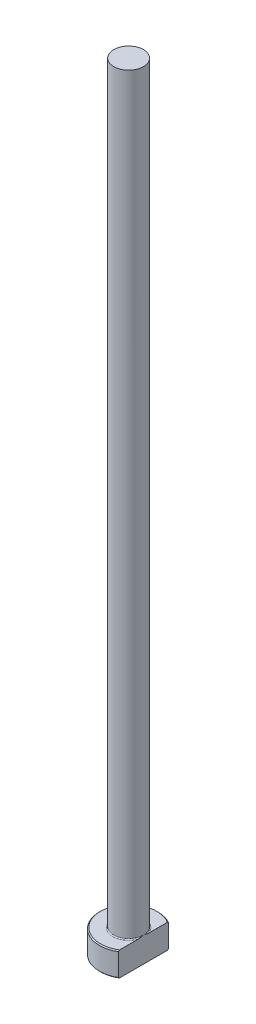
ISO-10303-21;
HEADER;
FILE_DESCRIPTION(('STEP AP214'),'2;1');
FILE_NAME('part.step','',(''),(''),'','','');
FILE_SCHEMA(('AUTOMOTIVE_DESIGN { 1 0 10303 214 1 1 1 1 }'));
ENDSEC;
DATA;
#1=APPLICATION_CONTEXT('core data for automotive mechanical design processes');
#2=APPLICATION_PROTOCOL_DEFINITION('international standard','automotive_design',2000,#1);
#3=PRODUCT_CONTEXT('',#1,'mechanical');
#4=PRODUCT('Part','Part','',(#3));
#5=PRODUCT_RELATED_PRODUCT_CATEGORY('part','',(#4));
#6=PRODUCT_DEFINITION_FORMATION('','',#4);
#7=PRODUCT_DEFINITION_CONTEXT('part definition',#1,'design');
#8=PRODUCT_DEFINITION('design','',#6,#7);
#9=PRODUCT_DEFINITION_SHAPE('','',#8);
#10=(LENGTH_UNIT() NAMED_UNIT(*) SI_UNIT(.MILLI.,.METRE.));
#11=(NAMED_UNIT(*) PLANE_ANGLE_UNIT() SI_UNIT($,.RADIAN.));
#12=(NAMED_UNIT(*) SI_UNIT($,.STERADIAN.) SOLID_ANGLE_UNIT());
#13=UNCERTAINTY_MEASURE_WITH_UNIT(LENGTH_MEASURE(1.E-05),#10,'distance_accuracy_value','');
#14=(GEOMETRIC_REPRESENTATION_CONTEXT(3) GLOBAL_UNCERTAINTY_ASSIGNED_CONTEXT((#13)) GLOBAL_UNIT_ASSIGNED_CONTEXT((#10,
#11,#12)) REPRESENTATION_CONTEXT('',''));
#15=CARTESIAN_POINT('',(0.,0.,0.));
#16=DIRECTION('',(0.,0.,1.));
#17=DIRECTION('',(1.,0.,0.));
#18=AXIS2_PLACEMENT_3D('',#15,#16,#17);
#19=CARTESIAN_POINT('',(0.,0.,0.));
#20=DIRECTION('',(0.,-1.,0.));
#21=DIRECTION('',(0.,0.,-1.));
#22=AXIS2_PLACEMENT_3D('',#19,#20,#21);
#23=PLANE('',#22);
#24=CARTESIAN_POINT('',(0.,0.,0.));
#25=DIRECTION('',(0.,-1.,0.));
#26=DIRECTION('',(0.,0.,-1.));
#27=AXIS2_PLACEMENT_3D('',#24,#25,#26);
#28=CIRCLE('',#27,5.79999999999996);
#29=CARTESIAN_POINT('',(3.04999999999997,0.,4.93330518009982));
#30=VERTEX_POINT('',#29);
#31=CARTESIAN_POINT('',(3.04999999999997,0.,-4.93330518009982));
#32=VERTEX_POINT('',#31);
#33=EDGE_CURVE('E98',#30,#32,#28,.T.);
#34=ORIENTED_EDGE('',*,*,#33,.T.);
#35=DIRECTION('',(0.,0.,1.));
#36=VECTOR('',#35,1.);
#37=CARTESIAN_POINT('',(3.04999999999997,0.,-5.16696235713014));
#38=LINE('',#37,#36);
#39=EDGE_CURVE('E83',#32,#30,#38,.T.);
#40=ORIENTED_EDGE('',*,*,#39,.T.);
#41=EDGE_LOOP('',(#34,#40));
#42=FACE_BOUND('',#41,.T.);
#43=ADVANCED_FACE('F32',(#42),#23,.T.);
#44=CARTESIAN_POINT('',(0.,259.958771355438,0.));
#45=DIRECTION('',(0.,1.,0.));
#46=DIRECTION('',(0.,0.,1.));
#47=AXIS2_PLACEMENT_3D('',#44,#45,#46);
#48=CYLINDRICAL_SURFACE('',#47,5.99999999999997);
#49=CARTESIAN_POINT('',(0.,4.79999999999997,0.));
#50=DIRECTION('',(0.,1.,0.));
#51=DIRECTION('',(0.,0.,1.));
#52=AXIS2_PLACEMENT_3D('',#49,#50,#51);
#53=CIRCLE('',#52,5.99999999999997);
#54=CARTESIAN_POINT('',(3.04999999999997,4.79999999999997,5.16696235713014));
#55=VERTEX_POINT('',#54);
#56=CARTESIAN_POINT('',(3.04999999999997,4.79999999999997,-5.16696235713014));
#57=VERTEX_POINT('',#56);
#58=EDGE_CURVE('E104',#55,#57,#53,.F.);
#59=ORIENTED_EDGE('',*,*,#58,.T.);
#60=DIRECTION('',(0.,-1.,0.));
#61=VECTOR('',#60,1.);
#62=CARTESIAN_POINT('',(3.04999999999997,160.,-5.16696235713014));
#63=LINE('',#62,#61);
#64=CARTESIAN_POINT('',(3.04999999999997,0.199999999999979,-5.16696235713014));
#65=VERTEX_POINT('',#64);
#66=EDGE_CURVE('E183',#57,#65,#63,.T.);
#67=ORIENTED_EDGE('',*,*,#66,.T.);
#68=CARTESIAN_POINT('',(0.,0.199999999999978,0.));
#69=DIRECTION('',(0.,-1.,0.));
#70=DIRECTION('',(0.,0.,-1.));
#71=AXIS2_PLACEMENT_3D('',#68,#69,#70);
#72=CIRCLE('',#71,5.99999999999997);
#73=CARTESIAN_POINT('',(3.04999999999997,0.199999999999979,5.16696235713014));
#74=VERTEX_POINT('',#73);
#75=EDGE_CURVE('E100',#65,#74,#72,.F.);
#76=ORIENTED_EDGE('',*,*,#75,.T.);
#77=DIRECTION('',(0.,-1.,0.));
#78=VECTOR('',#77,1.);
#79=CARTESIAN_POINT('',(3.04999999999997,160.,5.16696235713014));
#80=LINE('',#79,#78);
#81=EDGE_CURVE('E93',#55,#74,#80,.T.);
#82=ORIENTED_EDGE('',*,*,#81,.F.);
#83=EDGE_LOOP('',(#59,#67,#76,#82));
#84=FACE_BOUND('',#83,.T.);
#85=ADVANCED_FACE('F158',(#84),#48,.T.);
#86=CARTESIAN_POINT('',(-5.99999999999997,5.,0.));
#87=DIRECTION('',(0.,1.,0.));
#88=DIRECTION('',(0.,0.,1.));
#89=AXIS2_PLACEMENT_3D('',#86,#87,#88);
#90=PLANE('',#89);
#91=CARTESIAN_POINT('',(0.,5.,0.));
#92=DIRECTION('',(0.,1.,0.));
#93=DIRECTION('',(0.,0.,1.));
#94=AXIS2_PLACEMENT_3D('',#91,#92,#93);
#95=CIRCLE('',#94,5.79999999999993);
#96=CARTESIAN_POINT('',(3.04999999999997,5.,-4.93330518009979));
#97=VERTEX_POINT('',#96);
#98=CARTESIAN_POINT('',(3.04999999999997,5.,4.93330518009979));
#99=VERTEX_POINT('',#98);
#100=EDGE_CURVE('E178',#97,#99,#95,.T.);
#101=ORIENTED_EDGE('',*,*,#100,.T.);
#102=DIRECTION('',(0.,0.,-1.));
#103=VECTOR('',#102,1.);
#104=CARTESIAN_POINT('',(3.04999999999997,5.,0.));
#105=LINE('',#104,#103);
#106=CARTESIAN_POINT('',(3.04999999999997,4.99999999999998,1.12249721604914));
#107=VERTEX_POINT('',#106);
#108=EDGE_CURVE('E57',#99,#107,#105,.T.);
#109=ORIENTED_EDGE('',*,*,#108,.T.);
#110=CARTESIAN_POINT('',(0.,5.,0.));
#111=DIRECTION('',(0.,1.,0.));
#112=DIRECTION('',(0.,0.,1.));
#113=AXIS2_PLACEMENT_3D('',#110,#111,#112);
#114=CIRCLE('',#113,3.24999999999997);
#115=CARTESIAN_POINT('',(3.04999999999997,4.99999999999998,-1.12249721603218));
#116=VERTEX_POINT('',#115);
#117=EDGE_CURVE('E107',#107,#116,#114,.F.);
#118=ORIENTED_EDGE('',*,*,#117,.T.);
#119=EDGE_CURVE('E136',#116,#97,#105,.T.);
#120=ORIENTED_EDGE('',*,*,#119,.T.);
#121=EDGE_LOOP('',(#101,#109,#118,#120));
#122=FACE_BOUND('',#121,.T.);
#123=ADVANCED_FACE('F147',(#122),#90,.T.);
#124=CARTESIAN_POINT('',(0.,5.,0.));
#125=DIRECTION('',(0.,-1.,0.));
#126=DIRECTION('',(0.,0.,-1.));
#127=AXIS2_PLACEMENT_3D('',#124,#125,#126);
#128=CONICAL_SURFACE('',#127,5.79999999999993,0.785398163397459);
#129=ORIENTED_EDGE('',*,*,#58,.F.);
#130=CARTESIAN_POINT('',(3.04999999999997,-0.970698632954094,11.3686783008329));
#131=CARTESIAN_POINT('',(3.04999999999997,-0.729844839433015,11.1192942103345));
#132=CARTESIAN_POINT('',(3.04999999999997,-0.489253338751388,10.8696559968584));
#133=CARTESIAN_POINT('',(3.04999999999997,-0.0087427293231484,10.3697279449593));
#134=CARTESIAN_POINT('',(3.04999999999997,0.231176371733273,10.1194380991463));
#135=CARTESIAN_POINT('',(3.04999999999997,0.710295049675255,9.61795795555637));
#136=CARTESIAN_POINT('',(3.04999999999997,0.949494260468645,9.3667673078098));
#137=CARTESIAN_POINT('',(3.04999999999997,1.42684960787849,8.8633987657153));
#138=CARTESIAN_POINT('',(3.04999999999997,1.66500575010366,8.61122087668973));
#139=CARTESIAN_POINT('',(3.04999999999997,2.13559657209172,8.11027905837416));
#140=CARTESIAN_POINT('',(3.04999999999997,2.36805568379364,7.86153809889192));
#141=CARTESIAN_POINT('',(3.04999999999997,2.8312952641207,7.36249846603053));
#142=CARTESIAN_POINT('',(3.04999999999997,3.06207574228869,7.11219980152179));
#143=CARTESIAN_POINT('',(3.04999999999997,3.5213463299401,6.60959354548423));
#144=CARTESIAN_POINT('',(3.04999999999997,3.74983686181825,6.3572863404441));
#145=CARTESIAN_POINT('',(3.04999999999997,4.20371775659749,5.84990299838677));
#146=CARTESIAN_POINT('',(3.04999999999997,4.42910822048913,5.59482695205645));
#147=CARTESIAN_POINT('',(3.04999999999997,4.79887807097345,5.16894007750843));
#148=CARTESIAN_POINT('',(3.04999999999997,4.94452846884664,4.99923427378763));
#149=CARTESIAN_POINT('',(3.04999999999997,5.23331494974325,4.6576627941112));
#150=CARTESIAN_POINT('',(3.04999999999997,5.37645078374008,4.48579690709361));
#151=CARTESIAN_POINT('',(3.04999999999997,5.66079096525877,4.13753558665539));
#152=CARTESIAN_POINT('',(3.04999999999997,5.80196080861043,3.96111185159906));
#153=CARTESIAN_POINT('',(3.04999999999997,6.07950752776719,3.60459087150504));
#154=CARTESIAN_POINT('',(3.04999999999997,6.21588558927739,3.42449455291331));
#155=CARTESIAN_POINT('',(3.04999999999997,6.48382052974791,3.05665019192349));
#156=CARTESIAN_POINT('',(3.04999999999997,6.61527833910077,2.86882893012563));
#157=CARTESIAN_POINT('',(3.04999999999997,6.80466567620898,2.58172885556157));
#158=CARTESIAN_POINT('',(3.04999999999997,6.86653995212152,2.48505688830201));
#159=CARTESIAN_POINT('',(3.04999999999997,6.98697221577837,2.28967595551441));
#160=CARTESIAN_POINT('',(3.04999999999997,7.04553056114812,2.1909672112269));
#161=CARTESIAN_POINT('',(3.04999999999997,7.15784145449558,1.99234566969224));
#162=CARTESIAN_POINT('',(3.04999999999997,7.2116422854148,1.89246054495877));
#163=CARTESIAN_POINT('',(3.04999999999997,7.31412145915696,1.69011096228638));
#164=CARTESIAN_POINT('',(3.04999999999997,7.36279884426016,1.58764602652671));
#165=CARTESIAN_POINT('',(3.04999999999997,7.49891065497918,1.27646394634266));
#166=CARTESIAN_POINT('',(3.04999999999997,7.57686498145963,1.06321933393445));
#167=CARTESIAN_POINT('',(3.04999999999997,7.66214701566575,0.743707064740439));
#168=CARTESIAN_POINT('',(3.04999999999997,7.68491750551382,0.641524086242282));
#169=CARTESIAN_POINT('',(3.04999999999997,7.72074349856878,0.4354325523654));
#170=CARTESIAN_POINT('',(3.04999999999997,7.73379998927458,0.331524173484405));
#171=CARTESIAN_POINT('',(3.04999999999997,7.74926869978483,0.123282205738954));
#172=CARTESIAN_POINT('',(3.04999999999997,7.75171909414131,0.0189514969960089));
#173=CARTESIAN_POINT('',(3.04999999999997,7.74589964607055,-0.189412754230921));
#174=CARTESIAN_POINT('',(3.04999999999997,7.7376290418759,-0.293446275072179));
#175=CARTESIAN_POINT('',(3.04999999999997,7.71106535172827,-0.499372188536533));
#176=CARTESIAN_POINT('',(3.04999999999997,7.69285104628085,-0.60127495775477));
#177=CARTESIAN_POINT('',(3.04999999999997,7.64758004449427,-0.803076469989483));
#178=CARTESIAN_POINT('',(3.04999999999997,7.62052218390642,-0.902974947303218));
#179=CARTESIAN_POINT('',(3.04999999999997,7.55873377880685,-1.10100969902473));
#180=CARTESIAN_POINT('',(3.04999999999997,7.52395724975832,-1.19913143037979));
#181=CARTESIAN_POINT('',(3.04999999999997,7.44818034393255,-1.39288710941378));
#182=CARTESIAN_POINT('',(3.04999999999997,7.40718118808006,-1.48852154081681));
#183=CARTESIAN_POINT('',(3.04999999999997,7.278801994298,-1.76725558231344));
#184=CARTESIAN_POINT('',(3.04999999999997,7.18437453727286,-1.94709912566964));
#185=CARTESIAN_POINT('',(3.04999999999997,6.98292889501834,-2.29966178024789));
#186=CARTESIAN_POINT('',(3.04999999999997,6.87589523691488,-2.4723717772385));
#187=CARTESIAN_POINT('',(3.04999999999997,6.65293850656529,-2.81286471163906));
#188=CARTESIAN_POINT('',(3.04999999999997,6.53698257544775,-2.98062594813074));
#189=CARTESIAN_POINT('',(3.04999999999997,6.29920889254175,-3.31177740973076));
#190=CARTESIAN_POINT('',(3.04999999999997,6.17739401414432,-3.4751697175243));
#191=CARTESIAN_POINT('',(3.04999999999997,5.92790480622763,-3.80077365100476));
#192=CARTESIAN_POINT('',(3.04999999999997,5.80017502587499,-3.96294258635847));
#193=CARTESIAN_POINT('',(3.04999999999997,5.54148279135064,-4.28469855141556));
#194=CARTESIAN_POINT('',(3.04999999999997,5.41052000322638,-4.4442853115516));
#195=CARTESIAN_POINT('',(3.04999999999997,5.14647056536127,-4.76104235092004));
#196=CARTESIAN_POINT('',(3.04999999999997,5.01338972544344,-4.91821748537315));
#197=CARTESIAN_POINT('',(3.04999999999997,4.74534141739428,-5.23095234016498));
#198=CARTESIAN_POINT('',(3.04999999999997,4.6103739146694,-5.38651203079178));
#199=CARTESIAN_POINT('',(3.04999999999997,4.25119607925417,-5.7965100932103));
#200=CARTESIAN_POINT('',(3.04999999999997,4.02571738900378,-6.04983649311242));
#201=CARTESIAN_POINT('',(3.04999999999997,3.57194090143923,-6.55395552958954));
#202=CARTESIAN_POINT('',(3.04999999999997,3.3436430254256,-6.80474809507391));
#203=CARTESIAN_POINT('',(3.04999999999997,2.88477169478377,-7.30466840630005));
#204=CARTESIAN_POINT('',(3.04999999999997,2.65419632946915,-7.55379439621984));
#205=CARTESIAN_POINT('',(3.04999999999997,2.19148976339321,-8.0505971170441));
#206=CARTESIAN_POINT('',(3.04999999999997,1.95935855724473,-8.29827384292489));
#207=CARTESIAN_POINT('',(3.04999999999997,1.50341144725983,-8.78239136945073));
#208=CARTESIAN_POINT('',(3.04999999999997,1.27964364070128,-9.01887750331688));
#209=CARTESIAN_POINT('',(3.04999999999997,0.831227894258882,-9.4910152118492));
#210=CARTESIAN_POINT('',(3.04999999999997,0.606579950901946,-9.72666678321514));
#211=CARTESIAN_POINT('',(3.04999999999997,0.156823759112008,-10.1970312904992));
#212=CARTESIAN_POINT('',(3.04999999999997,-0.0682837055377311,-10.4317449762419));
#213=CARTESIAN_POINT('',(3.04999999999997,-0.519082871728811,-10.9006068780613));
#214=CARTESIAN_POINT('',(3.04999999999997,-0.744774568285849,-11.1347550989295));
#215=CARTESIAN_POINT('',(3.04999999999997,-0.970698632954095,-11.3686783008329));
#216=B_SPLINE_CURVE_WITH_KNOTS('',3,(#130,#131,#132,#133,#134,#135,#136,#137,#138,#139,#140,
#141,#142,#143,#144,#145,#146,#147,#148,#149,#150,#151,#152,#153,#154,#155,#156,#157,#158,#159,
#160,#161,#162,#163,#164,#165,#166,#167,#168,#169,#170,#171,#172,#173,#174,#175,#176,#177,#178,
#179,#180,#181,#182,#183,#184,#185,#186,#187,#188,#189,#190,#191,#192,#193,#194,#195,#196,#197,
#198,#199,#200,#201,#202,#203,#204,#205,#206,#207,#208,#209,#210,#211,#212,#213,#214,#215),
.UNSPECIFIED.,.F.,.F.,(4,2,2,2,2,2,2,2,2,2,2,2,2,2,2,2,2,2,2,2,2,2,2,2,2,2,2,2,2,2,2,2,2,2,2,2,
2,2,2,2,2,2,4),(0.,1.04010969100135,2.08023122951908,3.12081383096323,4.16139083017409,
5.18274882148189,6.2041010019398,7.22526118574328,8.24638802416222,8.91728465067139,
9.58824734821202,10.2660415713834,10.9436668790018,11.6311554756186,11.9754354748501,
12.3196782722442,12.6598862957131,13.0001578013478,13.6781281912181,13.9918165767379,
14.3054730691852,14.6179996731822,14.9305484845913,15.2406562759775,15.550804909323,
15.8628533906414,16.1748407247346,16.7833414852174,17.3925970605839,18.0042149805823,
18.6155359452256,19.2347734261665,19.8540751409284,20.471899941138,21.0897360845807,
22.1071178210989,23.1245280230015,24.1428799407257,25.161235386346,26.1379513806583,
27.1146712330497,28.090310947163,29.065942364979),.UNSPECIFIED.);
#217=EDGE_CURVE('E135',#55,#99,#216,.T.);
#218=ORIENTED_EDGE('',*,*,#217,.T.);
#219=ORIENTED_EDGE('',*,*,#100,.F.);
#220=EDGE_CURVE('E127',#97,#57,#216,.T.);
#221=ORIENTED_EDGE('',*,*,#220,.T.);
#222=EDGE_LOOP('',(#129,#218,#219,#221));
#223=FACE_BOUND('',#222,.T.);
#224=ADVANCED_FACE('F143',(#223),#128,.T.);
#225=CARTESIAN_POINT('',(0.,0.199999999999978,0.));
#226=DIRECTION('',(0.,1.,0.));
#227=DIRECTION('',(0.,0.,1.));
#228=AXIS2_PLACEMENT_3D('',#225,#226,#227);
#229=CONICAL_SURFACE('',#228,5.99999999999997,0.785398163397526);
#230=ORIENTED_EDGE('',*,*,#75,.F.);
#231=CARTESIAN_POINT('',(3.04999999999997,5.97069863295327,-11.3686783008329));
#232=CARTESIAN_POINT('',(3.04999999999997,5.72984483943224,-11.1192942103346));
#233=CARTESIAN_POINT('',(3.04999999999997,5.48925333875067,-10.8696559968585));
#234=CARTESIAN_POINT('',(3.04999999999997,5.00874272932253,-10.3697279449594));
#235=CARTESIAN_POINT('',(3.04999999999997,4.76882362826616,-10.1194380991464));
#236=CARTESIAN_POINT('',(3.04999999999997,4.28970495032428,-9.61795795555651));
#237=CARTESIAN_POINT('',(3.04999999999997,4.05050573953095,-9.36676730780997));
#238=CARTESIAN_POINT('',(3.04999999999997,3.57315039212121,-8.86339876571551));
#239=CARTESIAN_POINT('',(3.04999999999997,3.33499424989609,-8.61122087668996));
#240=CARTESIAN_POINT('',(3.04999999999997,2.86440342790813,-8.11027905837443));
#241=CARTESIAN_POINT('',(3.04999999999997,2.63194431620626,-7.86153809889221));
#242=CARTESIAN_POINT('',(3.04999999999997,2.16870473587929,-7.36249846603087));
#243=CARTESIAN_POINT('',(3.04999999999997,1.93792425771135,-7.11219980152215));
#244=CARTESIAN_POINT('',(3.04999999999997,1.47865367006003,-6.60959354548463));
#245=CARTESIAN_POINT('',(3.04999999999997,1.25016313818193,-6.35728634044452));
#246=CARTESIAN_POINT('',(3.04999999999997,0.796282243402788,-5.84990299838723));
#247=CARTESIAN_POINT('',(3.04999999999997,0.570891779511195,-5.59482695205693));
#248=CARTESIAN_POINT('',(3.04999999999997,0.201121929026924,-5.16894007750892));
#249=CARTESIAN_POINT('',(3.04999999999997,0.0554715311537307,-4.99923427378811));
#250=CARTESIAN_POINT('',(3.04999999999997,-0.233314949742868,-4.65766279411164));
#251=CARTESIAN_POINT('',(3.04999999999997,-0.376450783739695,-4.48579690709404));
#252=CARTESIAN_POINT('',(3.04999999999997,-0.660790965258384,-4.1375355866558));
#253=CARTESIAN_POINT('',(3.04999999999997,-0.801960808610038,-3.96111185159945));
#254=CARTESIAN_POINT('',(3.04999999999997,-1.07950752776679,-3.6045908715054));
#255=CARTESIAN_POINT('',(3.04999999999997,-1.21588558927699,-3.42449455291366));
#256=CARTESIAN_POINT('',(3.04999999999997,-1.4838205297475,-3.05665019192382));
#257=CARTESIAN_POINT('',(3.04999999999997,-1.61527833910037,-2.86882893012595));
#258=CARTESIAN_POINT('',(3.04999999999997,-1.80466567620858,-2.58172885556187));
#259=CARTESIAN_POINT('',(3.04999999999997,-1.86653995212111,-2.4850568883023));
#260=CARTESIAN_POINT('',(3.04999999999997,-1.98697221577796,-2.28967595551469));
#261=CARTESIAN_POINT('',(3.04999999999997,-2.04553056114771,-2.19096721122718));
#262=CARTESIAN_POINT('',(3.04999999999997,-2.15784145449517,-1.99234566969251));
#263=CARTESIAN_POINT('',(3.04999999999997,-2.21164228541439,-1.89246054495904));
#264=CARTESIAN_POINT('',(3.04999999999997,-2.31412145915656,-1.69011096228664));
#265=CARTESIAN_POINT('',(3.04999999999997,-2.36279884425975,-1.58764602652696));
#266=CARTESIAN_POINT('',(3.04999999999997,-2.49891065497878,-1.2764639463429));
#267=CARTESIAN_POINT('',(3.04999999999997,-2.57686498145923,-1.06321933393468));
#268=CARTESIAN_POINT('',(3.04999999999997,-2.66214701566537,-0.743707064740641));
#269=CARTESIAN_POINT('',(3.04999999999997,-2.68491750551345,-0.641524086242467));
#270=CARTESIAN_POINT('',(3.04999999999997,-2.72074349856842,-0.43543255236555));
#271=CARTESIAN_POINT('',(3.04999999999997,-2.73379998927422,-0.331524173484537));
#272=CARTESIAN_POINT('',(3.04999999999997,-2.74926869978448,-0.123282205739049));
#273=CARTESIAN_POINT('',(3.04999999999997,-2.75171909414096,-0.0189514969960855));
#274=CARTESIAN_POINT('',(3.04999999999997,-2.74589964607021,0.189412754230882));
#275=CARTESIAN_POINT('',(3.04999999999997,-2.73762904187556,0.293446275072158));
#276=CARTESIAN_POINT('',(3.04999999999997,-2.71106535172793,0.499372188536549));
#277=CARTESIAN_POINT('',(3.04999999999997,-2.69285104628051,0.601274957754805));
#278=CARTESIAN_POINT('',(3.04999999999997,-2.64758004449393,0.803076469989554));
#279=CARTESIAN_POINT('',(3.04999999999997,-2.62052218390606,0.902974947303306));
#280=CARTESIAN_POINT('',(3.04999999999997,-2.55873377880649,1.10100969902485));
#281=CARTESIAN_POINT('',(3.04999999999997,-2.52395724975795,1.19913143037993));
#282=CARTESIAN_POINT('',(3.04999999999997,-2.44818034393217,1.39288710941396));
#283=CARTESIAN_POINT('',(3.04999999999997,-2.40718118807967,1.488521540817));
#284=CARTESIAN_POINT('',(3.04999999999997,-2.27880199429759,1.76725558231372));
#285=CARTESIAN_POINT('',(3.04999999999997,-2.18437453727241,1.94709912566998));
#286=CARTESIAN_POINT('',(3.04999999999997,-1.98292889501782,2.29966178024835));
#287=CARTESIAN_POINT('',(3.04999999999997,-1.87589523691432,2.47237177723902));
#288=CARTESIAN_POINT('',(3.04999999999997,-1.65293850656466,2.8128647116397));
#289=CARTESIAN_POINT('',(3.04999999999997,-1.53698257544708,2.98062594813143));
#290=CARTESIAN_POINT('',(3.04999999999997,-1.299208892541,3.31177740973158));
#291=CARTESIAN_POINT('',(3.04999999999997,-1.17739401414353,3.47516971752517));
#292=CARTESIAN_POINT('',(3.04999999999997,-0.927904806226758,3.80077365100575));
#293=CARTESIAN_POINT('',(3.04999999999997,-0.800175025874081,3.96294258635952));
#294=CARTESIAN_POINT('',(3.04999999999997,-0.541482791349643,4.28469855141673));
#295=CARTESIAN_POINT('',(3.04999999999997,-0.410520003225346,4.44428531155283));
#296=CARTESIAN_POINT('',(3.04999999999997,-0.146470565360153,4.76104235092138));
#297=CARTESIAN_POINT('',(3.04999999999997,-0.0133897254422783,4.91821748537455));
#298=CARTESIAN_POINT('',(3.04999999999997,0.254658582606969,5.23095234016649));
#299=CARTESIAN_POINT('',(3.04999999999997,0.389626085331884,5.38651203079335));
#300=CARTESIAN_POINT('',(3.04999999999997,0.748803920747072,5.79651009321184));
#301=CARTESIAN_POINT('',(3.04999999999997,0.974282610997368,6.04983649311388));
#302=CARTESIAN_POINT('',(3.04999999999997,1.42805909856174,6.55395552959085));
#303=CARTESIAN_POINT('',(3.04999999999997,1.65635697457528,6.80474809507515));
#304=CARTESIAN_POINT('',(3.04999999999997,2.11522830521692,7.30466840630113));
#305=CARTESIAN_POINT('',(3.04999999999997,2.34580367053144,7.55379439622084));
#306=CARTESIAN_POINT('',(3.04999999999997,2.8085102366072,8.05059711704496));
#307=CARTESIAN_POINT('',(3.04999999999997,3.04064144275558,8.29827384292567));
#308=CARTESIAN_POINT('',(3.04999999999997,3.49658855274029,8.78239136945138));
#309=CARTESIAN_POINT('',(3.04999999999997,3.72035635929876,9.01887750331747));
#310=CARTESIAN_POINT('',(3.04999999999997,4.16877210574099,9.49101521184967));
#311=CARTESIAN_POINT('',(3.04999999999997,4.39342004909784,9.72666678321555));
#312=CARTESIAN_POINT('',(3.04999999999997,4.8431762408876,10.1970312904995));
#313=CARTESIAN_POINT('',(3.04999999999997,5.06828370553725,10.4317449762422));
#314=CARTESIAN_POINT('',(3.04999999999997,5.51908287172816,10.9006068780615));
#315=CARTESIAN_POINT('',(3.04999999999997,5.74477456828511,11.1347550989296));
#316=CARTESIAN_POINT('',(3.04999999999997,5.97069863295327,11.3686783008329));
#317=B_SPLINE_CURVE_WITH_KNOTS('',3,(#231,#232,#233,#234,#235,#236,#237,#238,#239,#240,#241,
#242,#243,#244,#245,#246,#247,#248,#249,#250,#251,#252,#253,#254,#255,#256,#257,#258,#259,#260,
#261,#262,#263,#264,#265,#266,#267,#268,#269,#270,#271,#272,#273,#274,#275,#276,#277,#278,#279,
#280,#281,#282,#283,#284,#285,#286,#287,#288,#289,#290,#291,#292,#293,#294,#295,#296,#297,#298,
#299,#300,#301,#302,#303,#304,#305,#306,#307,#308,#309,#310,#311,#312,#313,#314,#315,#316),
.UNSPECIFIED.,.F.,.F.,(4,2,2,2,2,2,2,2,2,2,2,2,2,2,2,2,2,2,2,2,2,2,2,2,2,2,2,2,2,2,2,2,2,2,2,2,
2,2,2,2,2,2,4),(0.,1.04010969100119,2.08023122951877,3.12081383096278,4.16139083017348,
5.18274882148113,6.20410100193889,7.22526118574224,8.24638802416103,8.91728465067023,
9.58824734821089,10.2660415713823,10.9436668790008,11.6311554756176,11.975435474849,
12.3196782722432,12.6598862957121,13.0001578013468,13.6781281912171,13.991816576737,
14.3054730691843,14.6179996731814,14.9305484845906,15.2406562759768,15.5508049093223,
15.8628533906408,16.1748407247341,16.7833414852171,17.3925970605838,18.0042149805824,
18.6155359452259,19.234773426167,19.8540751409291,20.4718999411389,21.0897360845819,
22.1071178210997,23.124528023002,24.1428799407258,25.1612353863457,26.1379513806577,
27.1146712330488,28.0903109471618,29.0659423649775),.UNSPECIFIED.);
#318=EDGE_CURVE('E86',#65,#32,#317,.T.);
#319=ORIENTED_EDGE('',*,*,#318,.T.);
#320=ORIENTED_EDGE('',*,*,#33,.F.);
#321=EDGE_CURVE('E89',#30,#74,#317,.T.);
#322=ORIENTED_EDGE('',*,*,#321,.T.);
#323=EDGE_LOOP('',(#230,#319,#320,#322));
#324=FACE_BOUND('',#323,.T.);
#325=ADVANCED_FACE('F97',(#324),#229,.T.);
#326=CARTESIAN_POINT('',(0.,5.19999999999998,0.));
#327=DIRECTION('',(0.,1.,0.));
#328=DIRECTION('',(0.,0.,1.));
#329=AXIS2_PLACEMENT_3D('',#326,#327,#328);
#330=TOROIDAL_SURFACE('',#329,3.24999999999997,0.2);
#331=CARTESIAN_POINT('',(3.04999999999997,5.19999999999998,0.));
#332=CARTESIAN_POINT('',(3.04999999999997,5.20000050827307,1.21234498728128E-10));
#333=CARTESIAN_POINT('',(3.04999999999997,5.2000010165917,-1.94554167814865E-07));
#334=CARTESIAN_POINT('',(3.04999999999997,5.20000196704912,-7.36231908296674E-07));
#335=CARTESIAN_POINT('',(3.04999999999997,5.20000239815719,-1.09605845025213E-06));
#336=CARTESIAN_POINT('',(3.04999999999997,5.20000329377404,-1.95768484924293E-06));
#337=CARTESIAN_POINT('',(3.04999999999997,5.20000374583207,-2.47339958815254E-06));
#338=CARTESIAN_POINT('',(3.04999999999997,5.20000455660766,-3.54344299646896E-06));
#339=CARTESIAN_POINT('',(3.04999999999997,5.20000491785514,-4.0960013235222E-06));
#340=CARTESIAN_POINT('',(3.04999999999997,5.20000625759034,-6.23288240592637E-06));
#341=CARTESIAN_POINT('',(3.04999999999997,5.20000716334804,-7.86540857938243E-06));
#342=CARTESIAN_POINT('',(3.04999999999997,5.20000865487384,-1.11012618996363E-05));
#343=CARTESIAN_POINT('',(3.04999999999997,5.20000926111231,-1.26955485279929E-05));
#344=CARTESIAN_POINT('',(3.04999999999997,5.20001180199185,-1.94350330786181E-05));
#345=CARTESIAN_POINT('',(3.04999999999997,5.20001369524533,-2.45990996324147E-05));
#346=CARTESIAN_POINT('',(3.04999999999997,5.20001648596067,-3.43608245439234E-05));
#347=CARTESIAN_POINT('',(3.04999999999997,5.20001748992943,-3.892785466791E-05));
#348=CARTESIAN_POINT('',(3.04999999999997,5.20002479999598,-7.28490938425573E-05));
#349=CARTESIAN_POINT('',(3.04999999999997,5.20003033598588,-0.000102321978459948));
#350=CARTESIAN_POINT('',(3.04999999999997,5.2000545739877,-0.000218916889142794));
#351=CARTESIAN_POINT('',(3.04999999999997,5.20007771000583,-0.000305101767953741));
#352=CARTESIAN_POINT('',(3.04999999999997,5.20016793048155,-0.000646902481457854));
#353=CARTESIAN_POINT('',(3.04999999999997,5.20023214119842,-0.00090303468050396));
#354=CARTESIAN_POINT('',(3.04999999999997,5.20048959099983,-0.00192235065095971));
#355=CARTESIAN_POINT('',(3.04999999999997,5.200686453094,-0.00268486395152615));
#356=CARTESIAN_POINT('',(3.04999999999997,5.20150513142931,-0.0058644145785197));
#357=CARTESIAN_POINT('',(3.04999999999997,5.20212238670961,-0.00828229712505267));
#358=CARTESIAN_POINT('',(3.04999999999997,5.20733075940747,-0.0286735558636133));
#359=CARTESIAN_POINT('',(3.04999999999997,5.21193872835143,-0.0466439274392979));
#360=CARTESIAN_POINT('',(3.04999999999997,5.22094200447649,-0.0818758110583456));
#361=CARTESIAN_POINT('',(3.04999999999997,5.22533847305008,-0.0991370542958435));
#362=CARTESIAN_POINT('',(3.04999999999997,5.23964641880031,-0.155525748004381));
#363=CARTESIAN_POINT('',(3.04999999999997,5.24949334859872,-0.194669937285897));
#364=CARTESIAN_POINT('',(3.04999999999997,5.26604342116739,-0.261710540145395));
#365=CARTESIAN_POINT('',(3.04999999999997,5.27283214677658,-0.289585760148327));
#366=CARTESIAN_POINT('',(3.04999999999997,5.28599220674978,-0.344649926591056));
#367=CARTESIAN_POINT('',(3.04999999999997,5.29236984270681,-0.371837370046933));
#368=CARTESIAN_POINT('',(3.04999999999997,5.31157589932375,-0.455723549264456));
#369=CARTESIAN_POINT('',(3.04999999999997,5.32392035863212,-0.512535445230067));
#370=CARTESIAN_POINT('',(3.04999999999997,5.34680977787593,-0.627095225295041));
#371=CARTESIAN_POINT('',(3.04999999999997,5.35733631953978,-0.684846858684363));
#372=CARTESIAN_POINT('',(3.04999999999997,5.37641100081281,-0.805890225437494));
#373=CARTESIAN_POINT('',(3.04999999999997,5.38470472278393,-0.869223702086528));
#374=CARTESIAN_POINT('',(3.04999999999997,5.39650442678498,-0.996147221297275));
#375=CARTESIAN_POINT('',(3.04999999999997,5.40002782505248,-1.05973547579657));
#376=CARTESIAN_POINT('',(3.04999999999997,5.39997784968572,-1.17309949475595));
#377=CARTESIAN_POINT('',(3.04999999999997,5.39778745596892,-1.22285605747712));
#378=CARTESIAN_POINT('',(3.04999999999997,5.38969143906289,-1.29668621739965));
#379=CARTESIAN_POINT('',(3.04999999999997,5.38622595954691,-1.32101834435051));
#380=CARTESIAN_POINT('',(3.04999999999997,5.37728481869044,-1.36928415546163));
#381=CARTESIAN_POINT('',(3.04999999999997,5.37181197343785,-1.39321834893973));
#382=CARTESIAN_POINT('',(3.04999999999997,5.35809904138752,-1.44077878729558));
#383=CARTESIAN_POINT('',(3.04999999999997,5.34981429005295,-1.46439322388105));
#384=CARTESIAN_POINT('',(3.04999999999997,5.33448033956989,-1.49846738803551));
#385=CARTESIAN_POINT('',(3.04999999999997,5.3288970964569,-1.5095822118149));
#386=CARTESIAN_POINT('',(3.04999999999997,5.3165352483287,-1.53111652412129));
#387=CARTESIAN_POINT('',(3.04999999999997,5.30975936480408,-1.54153752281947));
#388=CARTESIAN_POINT('',(3.04999999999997,5.29649230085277,-1.55894178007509));
#389=CARTESIAN_POINT('',(3.04999999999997,5.29030904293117,-1.56615709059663));
#390=CARTESIAN_POINT('',(3.04999999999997,5.27693406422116,-1.57958549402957));
#391=CARTESIAN_POINT('',(3.04999999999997,5.26974514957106,-1.58580127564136));
#392=CARTESIAN_POINT('',(3.04999999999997,5.25691386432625,-1.5948473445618));
#393=CARTESIAN_POINT('',(3.04999999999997,5.25157849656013,-1.59810970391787));
#394=CARTESIAN_POINT('',(3.04999999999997,5.24045977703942,-1.60376515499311));
#395=CARTESIAN_POINT('',(3.04999999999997,5.23467674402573,-1.60615885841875));
#396=CARTESIAN_POINT('',(3.04999999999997,5.22270107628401,-1.60988393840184));
#397=CARTESIAN_POINT('',(3.04999999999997,5.21650471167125,-1.61120363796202));
#398=CARTESIAN_POINT('',(3.04999999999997,5.2039743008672,-1.61257691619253));
#399=CARTESIAN_POINT('',(3.04999999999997,5.19764039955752,-1.61263176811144));
#400=CARTESIAN_POINT('',(3.04999999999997,5.18599578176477,-1.6115568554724));
#401=CARTESIAN_POINT('',(3.04999999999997,5.18066847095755,-1.61059566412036));
#402=CARTESIAN_POINT('',(3.04999999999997,5.17023814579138,-1.60783192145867));
#403=CARTESIAN_POINT('',(3.04999999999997,5.16513526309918,-1.60602888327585));
#404=CARTESIAN_POINT('',(3.04999999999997,5.1534435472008,-1.60092650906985));
#405=CARTESIAN_POINT('',(3.04999999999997,5.14698890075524,-1.59732150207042));
#406=CARTESIAN_POINT('',(3.04999999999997,5.13473509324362,-1.58913221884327));
#407=CARTESIAN_POINT('',(3.04999999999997,5.12893753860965,-1.58454561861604));
#408=CARTESIAN_POINT('',(3.04999999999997,5.11462865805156,-1.571659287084));
#409=CARTESIAN_POINT('',(3.04999999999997,5.10662306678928,-1.56280289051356));
#410=CARTESIAN_POINT('',(3.04999999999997,5.09200345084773,-1.54403227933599));
#411=CARTESIAN_POINT('',(3.04999999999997,5.08539179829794,-1.53411630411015));
#412=CARTESIAN_POINT('',(3.04999999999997,5.06752820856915,-1.50390051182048));
#413=CARTESIAN_POINT('',(3.04999999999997,5.05783763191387,-1.48268800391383));
#414=CARTESIAN_POINT('',(3.04999999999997,5.04132960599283,-1.43906853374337));
#415=CARTESIAN_POINT('',(3.04999999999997,5.03453663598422,-1.41665312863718));
#416=CARTESIAN_POINT('',(3.04999999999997,5.0206522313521,-1.36141193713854));
#417=CARTESIAN_POINT('',(3.04999999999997,5.01471674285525,-1.32829980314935));
#418=CARTESIAN_POINT('',(3.04999999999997,5.0059927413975,-1.26161040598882));
#419=CARTESIAN_POINT('',(3.04999999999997,5.00321404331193,-1.22803201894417));
#420=CARTESIAN_POINT('',(3.04999999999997,5.00011178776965,-1.16191365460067));
#421=CARTESIAN_POINT('',(3.04999999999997,4.99970809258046,-1.12937711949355));
#422=CARTESIAN_POINT('',(3.04999999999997,5.0006737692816,-1.06450961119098));
#423=CARTESIAN_POINT('',(3.04999999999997,5.00203387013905,-1.03217845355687));
#424=CARTESIAN_POINT('',(3.04999999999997,5.00868972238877,-0.928108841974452));
#425=CARTESIAN_POINT('',(3.04999999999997,5.0167646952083,-0.856551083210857));
#426=CARTESIAN_POINT('',(3.04999999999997,5.03767337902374,-0.712390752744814));
#427=CARTESIAN_POINT('',(3.04999999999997,5.05061983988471,-0.639806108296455));
#428=CARTESIAN_POINT('',(3.04999999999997,5.07500705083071,-0.518012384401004));
#429=CARTESIAN_POINT('',(3.04999999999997,5.08563897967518,-0.468637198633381));
#430=CARTESIAN_POINT('',(3.04999999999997,5.10778639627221,-0.370668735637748));
#431=CARTESIAN_POINT('',(3.04999999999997,5.11929064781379,-0.322072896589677));
#432=CARTESIAN_POINT('',(3.04999999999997,5.14155853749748,-0.230580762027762));
#433=CARTESIAN_POINT('',(3.04999999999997,5.15225641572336,-0.18766821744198));
#434=CARTESIAN_POINT('',(3.04999999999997,5.17439488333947,-0.100070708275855));
#435=CARTESIAN_POINT('',(3.04999999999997,5.18584763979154,-0.0553887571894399));
#436=CARTESIAN_POINT('',(3.04999999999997,5.19787889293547,-0.00827685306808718));
#437=CARTESIAN_POINT('',(3.04999999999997,5.19849761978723,-0.00585356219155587));
#438=CARTESIAN_POINT('',(3.04999999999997,5.19931663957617,-0.00267278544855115));
#439=CARTESIAN_POINT('',(3.04999999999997,5.19951241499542,-0.00191446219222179));
#440=CARTESIAN_POINT('',(3.04999999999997,5.19976854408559,-0.000900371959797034));
#441=CARTESIAN_POINT('',(3.04999999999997,5.19983249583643,-0.000645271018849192));
#442=CARTESIAN_POINT('',(3.04999999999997,5.19992240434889,-0.000304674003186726));
#443=CARTESIAN_POINT('',(3.04999999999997,5.19994549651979,-0.000218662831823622));
#444=CARTESIAN_POINT('',(3.04999999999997,5.19996969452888,-0.000102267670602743));
#445=CARTESIAN_POINT('',(3.04999999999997,5.19997522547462,-7.28190159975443E-05));
#446=CARTESIAN_POINT('',(3.04999999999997,5.19998252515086,-3.89225111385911E-05));
#447=CARTESIAN_POINT('',(3.04999999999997,5.19998352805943,-3.43568150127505E-05));
#448=CARTESIAN_POINT('',(3.04999999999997,5.19998631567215,-2.45978369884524E-05));
#449=CARTESIAN_POINT('',(3.04999999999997,5.1999882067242,-1.94351124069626E-05));
#450=CARTESIAN_POINT('',(3.04999999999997,5.1999907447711,-1.26970231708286E-05));
#451=CARTESIAN_POINT('',(3.04999999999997,5.19999135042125,-1.11028362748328E-05));
#452=CARTESIAN_POINT('',(3.04999999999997,5.1999928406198,-7.86708671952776E-06));
#453=CARTESIAN_POINT('',(3.04999999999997,5.19999374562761,-6.23455192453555E-06));
#454=CARTESIAN_POINT('',(3.04999999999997,5.19999508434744,-4.09754810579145E-06));
#455=CARTESIAN_POINT('',(3.04999999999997,5.19999544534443,-3.54492580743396E-06));
#456=CARTESIAN_POINT('',(3.04999999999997,5.19999625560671,-2.47470923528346E-06));
#457=CARTESIAN_POINT('',(3.04999999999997,5.19999670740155,-1.95888361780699E-06));
#458=CARTESIAN_POINT('',(3.04999999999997,5.19999760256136,-1.0969972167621E-06));
#459=CARTESIAN_POINT('',(3.04999999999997,5.19999803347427,-7.37031479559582E-07));
#460=CARTESIAN_POINT('',(3.04999999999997,5.19999898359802,-1.95001258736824E-07));
#461=CARTESIAN_POINT('',(3.04999999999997,5.19999949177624,-1.21222728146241E-10));
#462=CARTESIAN_POINT('',(3.04999999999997,5.19999999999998,0.));
#463=B_SPLINE_CURVE_WITH_KNOTS('',3,(#331,#332,#333,#334,#335,#336,#337,#338,#339,#340,#341,
#342,#343,#344,#345,#346,#347,#348,#349,#350,#351,#352,#353,#354,#355,#356,#357,#358,#359,#360,
#361,#362,#363,#364,#365,#366,#367,#368,#369,#370,#371,#372,#373,#374,#375,#376,#377,#378,#379,
#380,#381,#382,#383,#384,#385,#386,#387,#388,#389,#390,#391,#392,#393,#394,#395,#396,#397,#398,
#399,#400,#401,#402,#403,#404,#405,#406,#407,#408,#409,#410,#411,#412,#413,#414,#415,#416,#417,
#418,#419,#420,#421,#422,#423,#424,#425,#426,#427,#428,#429,#430,#431,#432,#433,#434,#435,#436,
#437,#438,#439,#440,#441,#442,#443,#444,#445,#446,#447,#448,#449,#450,#451,#452,#453,#454,#455,
#456,#457,#458,#459,#460,#461,#462),.UNSPECIFIED.,.T.,.F.,(4,2,2,2,2,2,2,2,2,2,2,2,2,2,2,2,2,2,
2,2,2,2,2,2,2,2,2,2,2,2,2,2,2,2,2,2,2,2,2,2,2,2,2,2,2,2,2,2,2,2,2,2,2,2,2,2,2,2,2,2,2,2,2,2,2,
4),(0.,1.5382752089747E-06,3.22415721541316E-06,5.2692011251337E-06,7.24861516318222E-06,
1.28291752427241E-05,1.79415577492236E-05,3.44133799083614E-05,4.84245514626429E-05,
0.000138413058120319,0.000405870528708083,0.00119830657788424,0.00356053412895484,
0.0110471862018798,0.0667008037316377,0.120138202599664,0.241228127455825,0.327297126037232,
0.41107297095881,0.585463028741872,0.761527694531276,0.953030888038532,1.14383300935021,
1.29292597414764,1.36659252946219,1.44015613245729,1.51494761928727,1.55221054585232,
1.58938951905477,1.61782336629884,1.64617939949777,1.66487921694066,1.68356584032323,
1.70245301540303,1.72132117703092,1.73748643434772,1.75366105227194,1.77571568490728,
1.7978231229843,1.8334356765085,1.86910835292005,1.93868184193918,2.00883198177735,
2.10950216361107,2.21048449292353,2.30803898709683,2.40508277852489,2.62085310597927,
2.84195966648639,2.99346730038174,3.14327714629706,3.27595462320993,3.41432907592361,
3.4218325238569,3.4241817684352,3.42497101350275,3.42523793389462,3.42532784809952,
3.42534185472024,3.42535832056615,3.42536343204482,3.42536901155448,3.42537099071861,
3.42537303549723,3.4253747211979,3.42537625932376),.UNSPECIFIED.);
#464=CARTESIAN_POINT('',(3.04999999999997,5.19999999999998,0.));
#465=VERTEX_POINT('',#464);
#466=EDGE_CURVE('E11',#116,#465,#463,.T.);
#467=ORIENTED_EDGE('',*,*,#466,.F.);
#468=ORIENTED_EDGE('',*,*,#117,.F.);
#469=CARTESIAN_POINT('',(3.04999999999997,5.19999999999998,0.));
#470=CARTESIAN_POINT('',(3.04999999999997,5.19999949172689,-1.2123455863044E-10));
#471=CARTESIAN_POINT('',(3.04999999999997,5.19999898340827,1.94554167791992E-07));
#472=CARTESIAN_POINT('',(3.04999999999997,5.19999803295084,7.36231908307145E-07));
#473=CARTESIAN_POINT('',(3.04999999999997,5.19999760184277,1.09605845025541E-06));
#474=CARTESIAN_POINT('',(3.04999999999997,5.19999670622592,1.95768484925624E-06));
#475=CARTESIAN_POINT('',(3.04999999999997,5.19999625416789,2.47339958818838E-06));
#476=CARTESIAN_POINT('',(3.04999999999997,5.1999954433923,3.54344299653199E-06));
#477=CARTESIAN_POINT('',(3.04999999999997,5.19999508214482,4.09600132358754E-06));
#478=CARTESIAN_POINT('',(3.04999999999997,5.19999374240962,6.23288240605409E-06));
#479=CARTESIAN_POINT('',(3.04999999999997,5.19999283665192,7.86540857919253E-06));
#480=CARTESIAN_POINT('',(3.04999999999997,5.19999134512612,1.11012618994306E-05));
#481=CARTESIAN_POINT('',(3.04999999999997,5.19999073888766,1.26955485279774E-05));
#482=CARTESIAN_POINT('',(3.04999999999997,5.19998819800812,1.94350330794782E-05));
#483=CARTESIAN_POINT('',(3.04999999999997,5.19998630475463,2.45990996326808E-05));
#484=CARTESIAN_POINT('',(3.04999999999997,5.1999835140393,3.43608245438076E-05));
#485=CARTESIAN_POINT('',(3.04999999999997,5.19998251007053,3.89278546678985E-05));
#486=CARTESIAN_POINT('',(3.04999999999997,5.19997520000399,7.28490938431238E-05));
#487=CARTESIAN_POINT('',(3.04999999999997,5.19996966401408,0.000102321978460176));
#488=CARTESIAN_POINT('',(3.04999999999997,5.19994542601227,0.000218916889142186));
#489=CARTESIAN_POINT('',(3.04999999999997,5.19992228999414,0.000305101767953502));
#490=CARTESIAN_POINT('',(3.04999999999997,5.19983206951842,0.000646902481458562));
#491=CARTESIAN_POINT('',(3.04999999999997,5.19976785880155,0.000903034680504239));
#492=CARTESIAN_POINT('',(3.04999999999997,5.19951040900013,0.00192235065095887));
#493=CARTESIAN_POINT('',(3.04999999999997,5.19931354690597,0.00268486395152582));
#494=CARTESIAN_POINT('',(3.04999999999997,5.19849486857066,0.00586441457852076));
#495=CARTESIAN_POINT('',(3.04999999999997,5.19787761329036,0.00828229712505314));
#496=CARTESIAN_POINT('',(3.04999999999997,5.19266924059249,0.0286735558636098));
#497=CARTESIAN_POINT('',(3.04999999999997,5.18806127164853,0.046643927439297));
#498=CARTESIAN_POINT('',(3.04999999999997,5.17905799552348,0.0818758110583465));
#499=CARTESIAN_POINT('',(3.04999999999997,5.17466152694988,0.0991370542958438));
#500=CARTESIAN_POINT('',(3.04999999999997,5.16035358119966,0.155525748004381));
#501=CARTESIAN_POINT('',(3.04999999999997,5.15050665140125,0.194669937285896));
#502=CARTESIAN_POINT('',(3.04999999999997,5.13395657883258,0.261710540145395));
#503=CARTESIAN_POINT('',(3.04999999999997,5.12716785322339,0.289585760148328));
#504=CARTESIAN_POINT('',(3.04999999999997,5.11400779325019,0.344649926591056));
#505=CARTESIAN_POINT('',(3.04999999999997,5.10763015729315,0.371837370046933));
#506=CARTESIAN_POINT('',(3.04999999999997,5.08842410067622,0.455723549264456));
#507=CARTESIAN_POINT('',(3.04999999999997,5.07607964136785,0.512535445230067));
#508=CARTESIAN_POINT('',(3.04999999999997,5.05319022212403,0.627095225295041));
#509=CARTESIAN_POINT('',(3.04999999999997,5.04266368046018,0.684846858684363));
#510=CARTESIAN_POINT('',(3.04999999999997,5.02358899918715,0.805890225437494));
#511=CARTESIAN_POINT('',(3.04999999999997,5.01529527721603,0.869223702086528));
#512=CARTESIAN_POINT('',(3.04999999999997,5.00349557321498,0.996147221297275));
#513=CARTESIAN_POINT('',(3.04999999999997,4.99997217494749,1.05973547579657));
#514=CARTESIAN_POINT('',(3.04999999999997,5.00002215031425,1.17309949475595));
#515=CARTESIAN_POINT('',(3.04999999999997,5.00221254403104,1.22285605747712));
#516=CARTESIAN_POINT('',(3.04999999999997,5.01030856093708,1.29668621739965));
#517=CARTESIAN_POINT('',(3.04999999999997,5.01377404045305,1.32101834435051));
#518=CARTESIAN_POINT('',(3.04999999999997,5.02271518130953,1.36928415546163));
#519=CARTESIAN_POINT('',(3.04999999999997,5.02818802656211,1.39321834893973));
#520=CARTESIAN_POINT('',(3.04999999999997,5.04190095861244,1.44077878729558));
#521=CARTESIAN_POINT('',(3.04999999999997,5.05018570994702,1.46439322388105));
#522=CARTESIAN_POINT('',(3.04999999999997,5.06551966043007,1.49846738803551));
#523=CARTESIAN_POINT('',(3.04999999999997,5.07110290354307,1.5095822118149));
#524=CARTESIAN_POINT('',(3.04999999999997,5.08346475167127,1.53111652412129));
#525=CARTESIAN_POINT('',(3.04999999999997,5.09024063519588,1.54153752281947));
#526=CARTESIAN_POINT('',(3.04999999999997,5.1035076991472,1.55894178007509));
#527=CARTESIAN_POINT('',(3.04999999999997,5.1096909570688,1.56615709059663));
#528=CARTESIAN_POINT('',(3.04999999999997,5.12306593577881,1.57958549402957));
#529=CARTESIAN_POINT('',(3.04999999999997,5.13025485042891,1.58580127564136));
#530=CARTESIAN_POINT('',(3.04999999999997,5.14308613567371,1.5948473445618));
#531=CARTESIAN_POINT('',(3.04999999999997,5.14842150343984,1.59810970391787));
#532=CARTESIAN_POINT('',(3.04999999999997,5.15954022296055,1.60376515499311));
#533=CARTESIAN_POINT('',(3.04999999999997,5.16532325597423,1.60615885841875));
#534=CARTESIAN_POINT('',(3.04999999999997,5.17729892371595,1.60988393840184));
#535=CARTESIAN_POINT('',(3.04999999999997,5.18349528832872,1.61120363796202));
#536=CARTESIAN_POINT('',(3.04999999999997,5.19602569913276,1.61257691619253));
#537=CARTESIAN_POINT('',(3.04999999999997,5.20235960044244,1.61263176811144));
#538=CARTESIAN_POINT('',(3.04999999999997,5.2140042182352,1.6115568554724));
#539=CARTESIAN_POINT('',(3.04999999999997,5.21933152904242,1.61059566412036));
#540=CARTESIAN_POINT('',(3.04999999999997,5.22976185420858,1.60783192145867));
#541=CARTESIAN_POINT('',(3.04999999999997,5.23486473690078,1.60602888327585));
#542=CARTESIAN_POINT('',(3.04999999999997,5.24655645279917,1.60092650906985));
#543=CARTESIAN_POINT('',(3.04999999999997,5.25301109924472,1.59732150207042));
#544=CARTESIAN_POINT('',(3.04999999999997,5.26526490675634,1.58913221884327));
#545=CARTESIAN_POINT('',(3.04999999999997,5.27106246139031,1.58454561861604));
#546=CARTESIAN_POINT('',(3.04999999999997,5.28537134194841,1.571659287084));
#547=CARTESIAN_POINT('',(3.04999999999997,5.29337693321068,1.56280289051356));
#548=CARTESIAN_POINT('',(3.04999999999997,5.30799654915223,1.54403227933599));
#549=CARTESIAN_POINT('',(3.04999999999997,5.31460820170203,1.53411630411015));
#550=CARTESIAN_POINT('',(3.04999999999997,5.33247179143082,1.50390051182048));
#551=CARTESIAN_POINT('',(3.04999999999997,5.3421623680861,1.48268800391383));
#552=CARTESIAN_POINT('',(3.04999999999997,5.35867039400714,1.43906853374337));
#553=CARTESIAN_POINT('',(3.04999999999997,5.36546336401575,1.41665312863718));
#554=CARTESIAN_POINT('',(3.04999999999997,5.37934776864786,1.36141193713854));
#555=CARTESIAN_POINT('',(3.04999999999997,5.38528325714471,1.32829980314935));
#556=CARTESIAN_POINT('',(3.04999999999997,5.39400725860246,1.26161040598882));
#557=CARTESIAN_POINT('',(3.04999999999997,5.39678595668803,1.22803201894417));
#558=CARTESIAN_POINT('',(3.04999999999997,5.39988821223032,1.16191365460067));
#559=CARTESIAN_POINT('',(3.04999999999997,5.40029190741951,1.12937711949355));
#560=CARTESIAN_POINT('',(3.04999999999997,5.39932623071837,1.06450961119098));
#561=CARTESIAN_POINT('',(3.04999999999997,5.39796612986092,1.03217845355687));
#562=CARTESIAN_POINT('',(3.04999999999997,5.39131027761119,0.928108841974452));
#563=CARTESIAN_POINT('',(3.04999999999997,5.38323530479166,0.856551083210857));
#564=CARTESIAN_POINT('',(3.04999999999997,5.36232662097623,0.712390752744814));
#565=CARTESIAN_POINT('',(3.04999999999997,5.34938016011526,0.639806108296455));
#566=CARTESIAN_POINT('',(3.04999999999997,5.32499294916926,0.518012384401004));
#567=CARTESIAN_POINT('',(3.04999999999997,5.31436102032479,0.468637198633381));
#568=CARTESIAN_POINT('',(3.04999999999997,5.29221360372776,0.370668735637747));
#569=CARTESIAN_POINT('',(3.04999999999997,5.28070935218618,0.322072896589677));
#570=CARTESIAN_POINT('',(3.04999999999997,5.25844146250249,0.230580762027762));
#571=CARTESIAN_POINT('',(3.04999999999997,5.2477435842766,0.187668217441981));
#572=CARTESIAN_POINT('',(3.04999999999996,5.22560511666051,0.100070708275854));
#573=CARTESIAN_POINT('',(3.04999999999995,5.21415236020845,0.0553887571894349));
#574=CARTESIAN_POINT('',(3.04999999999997,5.20212110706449,0.00827685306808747));
#575=CARTESIAN_POINT('',(3.04999999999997,5.20150238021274,0.00585356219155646));
#576=CARTESIAN_POINT('',(3.04999999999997,5.2006833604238,0.00267278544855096));
#577=CARTESIAN_POINT('',(3.04999999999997,5.20048758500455,0.00191446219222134));
#578=CARTESIAN_POINT('',(3.04999999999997,5.20023145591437,0.000900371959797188));
#579=CARTESIAN_POINT('',(3.04999999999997,5.20016750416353,0.000645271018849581));
#580=CARTESIAN_POINT('',(3.04999999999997,5.20007759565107,0.000304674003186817));
#581=CARTESIAN_POINT('',(3.04999999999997,5.20005450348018,0.000218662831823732));
#582=CARTESIAN_POINT('',(3.04999999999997,5.20003030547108,0.000102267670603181));
#583=CARTESIAN_POINT('',(3.04999999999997,5.20002477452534,7.28190159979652E-05));
#584=CARTESIAN_POINT('',(3.04999999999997,5.2000174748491,3.89225111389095E-05));
#585=CARTESIAN_POINT('',(3.04999999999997,5.20001647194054,3.43568150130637E-05));
#586=CARTESIAN_POINT('',(3.04999999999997,5.20001368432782,2.45978369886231E-05));
#587=CARTESIAN_POINT('',(3.04999999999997,5.20001179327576,1.9435112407E-05));
#588=CARTESIAN_POINT('',(3.04999999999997,5.20000925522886,1.26970231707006E-05));
#589=CARTESIAN_POINT('',(3.04999999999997,5.20000864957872,1.1102836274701E-05));
#590=CARTESIAN_POINT('',(3.04999999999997,5.20000715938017,7.86708671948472E-06));
#591=CARTESIAN_POINT('',(3.04999999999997,5.20000625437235,6.23455192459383E-06));
#592=CARTESIAN_POINT('',(3.04999999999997,5.20000491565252,4.09754810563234E-06));
#593=CARTESIAN_POINT('',(3.04999999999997,5.20000455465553,3.54492580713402E-06));
#594=CARTESIAN_POINT('',(3.04999999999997,5.20000374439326,2.47470923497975E-06));
#595=CARTESIAN_POINT('',(3.04999999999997,5.20000329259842,1.95888361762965E-06));
#596=CARTESIAN_POINT('',(3.04999999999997,5.20000239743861,1.09699721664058E-06));
#597=CARTESIAN_POINT('',(3.04999999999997,5.2000019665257,7.37031479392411E-07));
#598=CARTESIAN_POINT('',(3.04999999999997,5.20000101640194,1.95001258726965E-07));
#599=CARTESIAN_POINT('',(3.04999999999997,5.20000050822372,1.21222787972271E-10));
#600=CARTESIAN_POINT('',(3.04999999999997,5.19999999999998,0.));
#601=B_SPLINE_CURVE_WITH_KNOTS('',3,(#469,#470,#471,#472,#473,#474,#475,#476,#477,#478,#479,
#480,#481,#482,#483,#484,#485,#486,#487,#488,#489,#490,#491,#492,#493,#494,#495,#496,#497,#498,
#499,#500,#501,#502,#503,#504,#505,#506,#507,#508,#509,#510,#511,#512,#513,#514,#515,#516,#517,
#518,#519,#520,#521,#522,#523,#524,#525,#526,#527,#528,#529,#530,#531,#532,#533,#534,#535,#536,
#537,#538,#539,#540,#541,#542,#543,#544,#545,#546,#547,#548,#549,#550,#551,#552,#553,#554,#555,
#556,#557,#558,#559,#560,#561,#562,#563,#564,#565,#566,#567,#568,#569,#570,#571,#572,#573,#574,
#575,#576,#577,#578,#579,#580,#581,#582,#583,#584,#585,#586,#587,#588,#589,#590,#591,#592,#593,
#594,#595,#596,#597,#598,#599,#600),.UNSPECIFIED.,.T.,.F.,(4,2,2,2,2,2,2,2,2,2,2,2,2,2,2,2,2,2,
2,2,2,2,2,2,2,2,2,2,2,2,2,2,2,2,2,2,2,2,2,2,2,2,2,2,2,2,2,2,2,2,2,2,2,2,2,2,2,2,2,2,2,2,2,2,2,
4),(0.,1.53827520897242E-06,3.22415721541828E-06,5.26920112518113E-06,7.24861516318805E-06,
1.28291752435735E-05,1.79415577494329E-05,3.44133799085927E-05,4.84245514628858E-05,
0.000138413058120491,0.000405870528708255,0.00119830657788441,0.00356053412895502,
0.0110471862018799,0.0667008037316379,0.120138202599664,0.241228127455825,0.327297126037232,
0.41107297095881,0.585463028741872,0.761527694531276,0.953030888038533,1.14383300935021,
1.29292597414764,1.36659252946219,1.44015613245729,1.51494761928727,1.55221054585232,
1.58938951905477,1.61782336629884,1.64617939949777,1.66487921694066,1.68356584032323,
1.70245301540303,1.72132117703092,1.73748643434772,1.75366105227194,1.77571568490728,
1.7978231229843,1.8334356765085,1.86910835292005,1.93868184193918,2.00883198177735,
2.10950216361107,2.21048449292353,2.30803898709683,2.40508277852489,2.62085310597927,
2.84195966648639,2.99346730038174,3.14327714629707,3.27595462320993,3.41432907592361,
3.4218325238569,3.4241817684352,3.42497101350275,3.42523793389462,3.42532784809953,
3.42534185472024,3.42535832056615,3.42536343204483,3.42536901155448,3.42537099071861,
3.42537303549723,3.42537472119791,3.42537625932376),.UNSPECIFIED.);
#602=EDGE_CURVE('E46',#465,#107,#601,.T.);
#603=ORIENTED_EDGE('',*,*,#602,.F.);
#604=CARTESIAN_POINT('',(0.,5.19999999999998,0.));
#605=DIRECTION('',(0.,1.,0.));
#606=DIRECTION('',(0.,0.,1.));
#607=AXIS2_PLACEMENT_3D('',#604,#605,#606);
#608=CIRCLE('',#607,3.04999999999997);
#609=EDGE_CURVE('E103',#465,#465,#608,.T.);
#610=ORIENTED_EDGE('',*,*,#609,.F.);
#611=EDGE_LOOP('',(#467,#468,#603,#610));
#612=FACE_BOUND('',#611,.T.);
#613=ADVANCED_FACE('F34',(#612),#330,.F.);
#614=CARTESIAN_POINT('',(0.,259.958771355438,0.));
#615=DIRECTION('',(0.,1.,0.));
#616=DIRECTION('',(0.,0.,1.));
#617=AXIS2_PLACEMENT_3D('',#614,#615,#616);
#618=CYLINDRICAL_SURFACE('',#617,3.04999999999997);
#619=ORIENTED_EDGE('',*,*,#609,.T.);
#620=EDGE_LOOP('',(#619));
#621=FACE_BOUND('',#620,.T.);
#622=CARTESIAN_POINT('',(0.,160.,0.));
#623=DIRECTION('',(0.,1.,0.));
#624=DIRECTION('',(0.,0.,1.));
#625=AXIS2_PLACEMENT_3D('',#622,#623,#624);
#626=CIRCLE('',#625,3.04999999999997);
#627=CARTESIAN_POINT('',(0.,160.,3.04999999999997));
#628=VERTEX_POINT('',#627);
#629=EDGE_CURVE('E101',#628,#628,#626,.T.);
#630=ORIENTED_EDGE('',*,*,#629,.F.);
#631=EDGE_LOOP('',(#630));
#632=FACE_BOUND('',#631,.T.);
#633=ADVANCED_FACE('F155',(#621,#632),#618,.T.);
#634=CARTESIAN_POINT('',(-3.04999999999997,160.,0.));
#635=DIRECTION('',(0.,1.,0.));
#636=DIRECTION('',(0.,0.,1.));
#637=AXIS2_PLACEMENT_3D('',#634,#635,#636);
#638=PLANE('',#637);
#639=ORIENTED_EDGE('',*,*,#629,.T.);
#640=EDGE_LOOP('',(#639));
#641=FACE_BOUND('',#640,.T.);
#642=ADVANCED_FACE('F121',(#641),#638,.T.);
#643=CARTESIAN_POINT('',(3.04999999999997,160.,-5.16696235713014));
#644=DIRECTION('',(1.,0.,0.));
#645=DIRECTION('',(0.,0.,-1.));
#646=AXIS2_PLACEMENT_3D('',#643,#644,#645);
#647=PLANE('',#646);
#648=ORIENTED_EDGE('',*,*,#66,.F.);
#649=ORIENTED_EDGE('',*,*,#220,.F.);
#650=ORIENTED_EDGE('',*,*,#119,.F.);
#651=ORIENTED_EDGE('',*,*,#466,.T.);
#652=ORIENTED_EDGE('',*,*,#602,.T.);
#653=ORIENTED_EDGE('',*,*,#108,.F.);
#654=ORIENTED_EDGE('',*,*,#217,.F.);
#655=ORIENTED_EDGE('',*,*,#81,.T.);
#656=ORIENTED_EDGE('',*,*,#321,.F.);
#657=ORIENTED_EDGE('',*,*,#39,.F.);
#658=ORIENTED_EDGE('',*,*,#318,.F.);
#659=EDGE_LOOP('',(#648,#649,#650,#651,#652,#653,#654,#655,#656,#657,#658));
#660=FACE_BOUND('',#659,.T.);
#661=ADVANCED_FACE('F85',(#660),#647,.T.);
#662=CLOSED_SHELL('',(#43,#85,#123,#224,#325,#613,#633,#642,#661));
#663=MANIFOLD_SOLID_BREP('B2',#662);
#664=ADVANCED_BREP_SHAPE_REPRESENTATION('',(#18,#663),#14);
#665=SHAPE_DEFINITION_REPRESENTATION(#9,#664);
ENDSEC;
END-ISO-10303-21;
